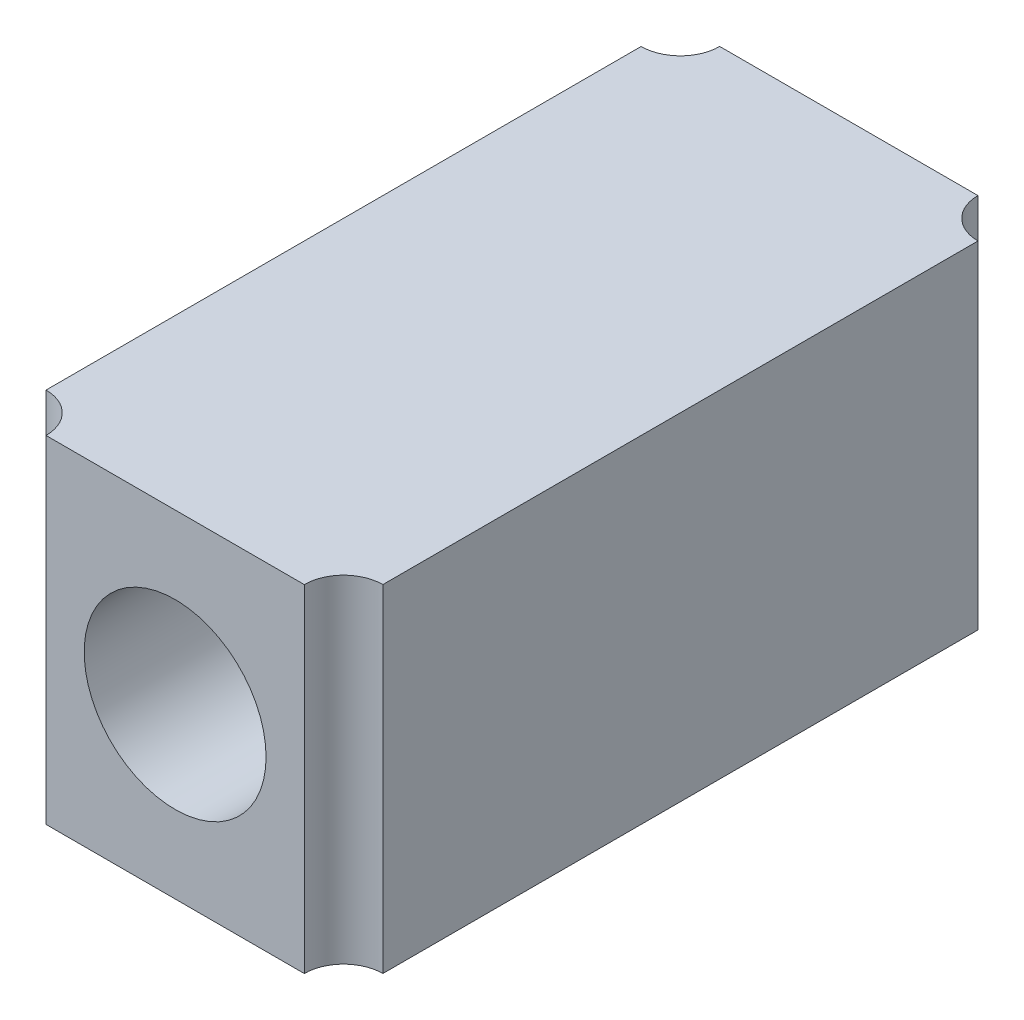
from build123d import *

# Parameters (mm, degrees)
SKETCH1_W           = 15
SKETCH1_H           = 15
SKETCH1_R           = 4.05
BOSS_EXTRUDE1_DEPTH = 30
SKETCH2_R           = 1.75
CUT_EXTRUDE1_DEPTH  = 35.369317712


with BuildPart() as part:
    # Sketch1 → Boss-Extrude1 (new body)
    with BuildSketch(Plane.XY):
        Rectangle(SKETCH1_W, SKETCH1_H)
        Circle(SKETCH1_R, mode=Mode.SUBTRACT)
    extrude(amount=BOSS_EXTRUDE1_DEPTH)

    # Sketch2 → Cut-Extrude1 (cut, through all)
    with BuildSketch(Plane(origin=(0, 7.5, 0), x_dir=(1, 0, 0), z_dir=(0, 1, 0))):
        with Locations((7.5, -30)):
            Circle(SKETCH2_R)
        with Locations((7.5, 0)):
            Circle(SKETCH2_R)
        with Locations((-7.5, 0)):
            Circle(SKETCH2_R)
        with Locations((-7.5, -30)):
            Circle(SKETCH2_R)
    extrude(amount=-CUT_EXTRUDE1_DEPTH, mode=Mode.SUBTRACT)


solid = part.part
